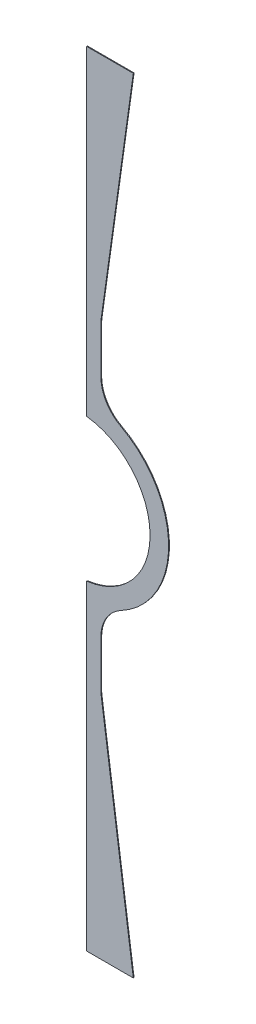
ISO-10303-21;
HEADER;
FILE_DESCRIPTION(('STEP AP214'),'2;1');
FILE_NAME('part.step','',(''),(''),'','','');
FILE_SCHEMA(('AUTOMOTIVE_DESIGN { 1 0 10303 214 1 1 1 1 }'));
ENDSEC;
DATA;
#1=APPLICATION_CONTEXT('core data for automotive mechanical design processes');
#2=APPLICATION_PROTOCOL_DEFINITION('international standard','automotive_design',2000,#1);
#3=PRODUCT_CONTEXT('',#1,'mechanical');
#4=PRODUCT('Part','Part','',(#3));
#5=PRODUCT_RELATED_PRODUCT_CATEGORY('part','',(#4));
#6=PRODUCT_DEFINITION_FORMATION('','',#4);
#7=PRODUCT_DEFINITION_CONTEXT('part definition',#1,'design');
#8=PRODUCT_DEFINITION('design','',#6,#7);
#9=PRODUCT_DEFINITION_SHAPE('','',#8);
#10=(LENGTH_UNIT() NAMED_UNIT(*) SI_UNIT(.MILLI.,.METRE.));
#11=(NAMED_UNIT(*) PLANE_ANGLE_UNIT() SI_UNIT($,.RADIAN.));
#12=(NAMED_UNIT(*) SI_UNIT($,.STERADIAN.) SOLID_ANGLE_UNIT());
#13=UNCERTAINTY_MEASURE_WITH_UNIT(LENGTH_MEASURE(1.E-05),#10,'distance_accuracy_value','');
#14=(GEOMETRIC_REPRESENTATION_CONTEXT(3) GLOBAL_UNCERTAINTY_ASSIGNED_CONTEXT((#13)) GLOBAL_UNIT_ASSIGNED_CONTEXT((#10,
#11,#12)) REPRESENTATION_CONTEXT('',''));
#15=CARTESIAN_POINT('',(0.,0.,0.));
#16=DIRECTION('',(0.,0.,1.));
#17=DIRECTION('',(1.,0.,0.));
#18=AXIS2_PLACEMENT_3D('',#15,#16,#17);
#19=CARTESIAN_POINT('',(32.,83.9859004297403,0.205));
#20=DIRECTION('',(0.,0.,-1.));
#21=DIRECTION('',(-1.,0.,0.));
#22=AXIS2_PLACEMENT_3D('',#19,#20,#21);
#23=CYLINDRICAL_SURFACE('',#22,20.);
#24=CARTESIAN_POINT('',(32.,83.9859004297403,-0.205));
#25=DIRECTION('',(0.,0.,-1.));
#26=DIRECTION('',(1.,0.,0.));
#27=AXIS2_PLACEMENT_3D('',#24,#25,#26);
#28=CIRCLE('',#27,20.);
#29=CARTESIAN_POINT('',(12.,83.9859004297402,-0.205));
#30=VERTEX_POINT('',#29);
#31=CARTESIAN_POINT('',(12.1946386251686,86.7693624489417,-0.205));
#32=VERTEX_POINT('',#31);
#33=EDGE_CURVE('E163',#30,#32,#28,.T.);
#34=ORIENTED_EDGE('',*,*,#33,.T.);
#35=DIRECTION('',(0.,0.,-1.));
#36=VECTOR('',#35,1.);
#37=CARTESIAN_POINT('',(12.1946386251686,86.7693624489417,0.205));
#38=LINE('',#37,#36);
#39=CARTESIAN_POINT('',(12.1946386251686,86.7693624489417,0.205));
#40=VERTEX_POINT('',#39);
#41=EDGE_CURVE('E11',#40,#32,#38,.T.);
#42=ORIENTED_EDGE('',*,*,#41,.F.);
#43=CARTESIAN_POINT('',(32.,83.9859004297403,0.205));
#44=DIRECTION('',(0.,0.,-1.));
#45=DIRECTION('',(1.,0.,0.));
#46=AXIS2_PLACEMENT_3D('',#43,#44,#45);
#47=CIRCLE('',#46,20.);
#48=CARTESIAN_POINT('',(12.,83.9859004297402,0.205));
#49=VERTEX_POINT('',#48);
#50=EDGE_CURVE('E189',#49,#40,#47,.T.);
#51=ORIENTED_EDGE('',*,*,#50,.F.);
#52=DIRECTION('',(0.,0.,-1.));
#53=VECTOR('',#52,1.);
#54=CARTESIAN_POINT('',(12.,83.9859004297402,0.205));
#55=LINE('',#54,#53);
#56=EDGE_CURVE('E159',#49,#30,#55,.T.);
#57=ORIENTED_EDGE('',*,*,#56,.T.);
#58=EDGE_LOOP('',(#34,#42,#51,#57));
#59=FACE_BOUND('',#58,.T.);
#60=ADVANCED_FACE('F31',(#59),#23,.F.);
#61=CARTESIAN_POINT('',(29.2324936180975,208.,0.205));
#62=DIRECTION('',(-0.99026806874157,0.139173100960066,0.));
#63=DIRECTION('',(-0.139173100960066,-0.99026806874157,0.));
#64=AXIS2_PLACEMENT_3D('',#61,#62,#63);
#65=PLANE('',#64);
#66=DIRECTION('',(0.139173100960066,0.99026806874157,0.));
#67=VECTOR('',#66,1.);
#68=CARTESIAN_POINT('',(29.2324936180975,208.,-0.205));
#69=LINE('',#68,#67);
#70=CARTESIAN_POINT('',(29.2324936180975,208.,-0.205));
#71=VERTEX_POINT('',#70);
#72=EDGE_CURVE('E166',#32,#71,#69,.T.);
#73=ORIENTED_EDGE('',*,*,#72,.T.);
#74=DIRECTION('',(0.,0.,-1.));
#75=VECTOR('',#74,1.);
#76=CARTESIAN_POINT('',(29.2324936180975,208.,0.205));
#77=LINE('',#76,#75);
#78=CARTESIAN_POINT('',(29.2324936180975,208.,0.205));
#79=VERTEX_POINT('',#78);
#80=EDGE_CURVE('E39',#79,#71,#77,.T.);
#81=ORIENTED_EDGE('',*,*,#80,.F.);
#82=DIRECTION('',(0.139173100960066,0.99026806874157,0.));
#83=VECTOR('',#82,1.);
#84=CARTESIAN_POINT('',(29.2324936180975,208.,0.205));
#85=LINE('',#84,#83);
#86=EDGE_CURVE('E108',#40,#79,#85,.T.);
#87=ORIENTED_EDGE('',*,*,#86,.F.);
#88=ORIENTED_EDGE('',*,*,#41,.T.);
#89=EDGE_LOOP('',(#73,#81,#87,#88));
#90=FACE_BOUND('',#89,.T.);
#91=ADVANCED_FACE('F277',(#90),#65,.F.);
#92=CARTESIAN_POINT('',(29.2324936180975,208.,0.205));
#93=DIRECTION('',(0.,-1.,0.));
#94=DIRECTION('',(0.,0.,-1.));
#95=AXIS2_PLACEMENT_3D('',#92,#93,#94);
#96=PLANE('',#95);
#97=DIRECTION('',(-1.,0.,0.));
#98=VECTOR('',#97,1.);
#99=CARTESIAN_POINT('',(29.2324936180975,208.,-0.205));
#100=LINE('',#99,#98);
#101=CARTESIAN_POINT('',(4.49999999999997,208.,-0.205));
#102=VERTEX_POINT('',#101);
#103=EDGE_CURVE('E168',#71,#102,#100,.T.);
#104=ORIENTED_EDGE('',*,*,#103,.T.);
#105=DIRECTION('',(0.,0.,-1.));
#106=VECTOR('',#105,1.);
#107=CARTESIAN_POINT('',(4.49999999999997,208.,0.205));
#108=LINE('',#107,#106);
#109=CARTESIAN_POINT('',(4.49999999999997,208.,0.205));
#110=VERTEX_POINT('',#109);
#111=EDGE_CURVE('E214',#110,#102,#108,.T.);
#112=ORIENTED_EDGE('',*,*,#111,.F.);
#113=DIRECTION('',(-1.,0.,0.));
#114=VECTOR('',#113,1.);
#115=CARTESIAN_POINT('',(29.2324936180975,208.,0.205));
#116=LINE('',#115,#114);
#117=EDGE_CURVE('E222',#79,#110,#116,.T.);
#118=ORIENTED_EDGE('',*,*,#117,.F.);
#119=ORIENTED_EDGE('',*,*,#80,.T.);
#120=EDGE_LOOP('',(#104,#112,#118,#119));
#121=FACE_BOUND('',#120,.T.);
#122=ADVANCED_FACE('F220',(#121),#96,.F.);
#123=CARTESIAN_POINT('',(4.49999999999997,208.,0.205));
#124=DIRECTION('',(1.,0.,0.));
#125=DIRECTION('',(0.,1.,0.));
#126=AXIS2_PLACEMENT_3D('',#123,#124,#125);
#127=PLANE('',#126);
#128=DIRECTION('',(0.,-1.,0.));
#129=VECTOR('',#128,1.);
#130=CARTESIAN_POINT('',(4.49999999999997,208.,-0.205));
#131=LINE('',#130,#129);
#132=CARTESIAN_POINT('',(4.49999999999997,37.8736723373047,-0.205));
#133=VERTEX_POINT('',#132);
#134=EDGE_CURVE('E170',#102,#133,#131,.T.);
#135=ORIENTED_EDGE('',*,*,#134,.T.);
#136=DIRECTION('',(0.,0.,-1.));
#137=VECTOR('',#136,1.);
#138=CARTESIAN_POINT('',(4.49999999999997,37.8736723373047,0.205));
#139=LINE('',#138,#137);
#140=CARTESIAN_POINT('',(4.49999999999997,37.8736723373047,0.205));
#141=VERTEX_POINT('',#140);
#142=EDGE_CURVE('E211',#141,#133,#139,.T.);
#143=ORIENTED_EDGE('',*,*,#142,.F.);
#144=DIRECTION('',(0.,-1.,0.));
#145=VECTOR('',#144,1.);
#146=CARTESIAN_POINT('',(4.49999999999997,208.,0.205));
#147=LINE('',#146,#145);
#148=EDGE_CURVE('E240',#110,#141,#147,.T.);
#149=ORIENTED_EDGE('',*,*,#148,.F.);
#150=ORIENTED_EDGE('',*,*,#111,.T.);
#151=EDGE_LOOP('',(#135,#143,#149,#150));
#152=FACE_BOUND('',#151,.T.);
#153=ADVANCED_FACE('F231',(#152),#127,.F.);
#154=CARTESIAN_POINT('',(0.,0.,0.205));
#155=DIRECTION('',(0.,0.,-1.));
#156=DIRECTION('',(-1.,0.,0.));
#157=AXIS2_PLACEMENT_3D('',#154,#155,#156);
#158=CYLINDRICAL_SURFACE('',#157,38.14007153);
#159=CARTESIAN_POINT('',(0.,0.,-0.205));
#160=DIRECTION('',(0.,0.,-1.));
#161=DIRECTION('',(1.,0.,0.));
#162=AXIS2_PLACEMENT_3D('',#159,#160,#161);
#163=CIRCLE('',#162,38.14007153);
#164=CARTESIAN_POINT('',(4.49999999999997,-37.8736723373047,-0.205));
#165=VERTEX_POINT('',#164);
#166=EDGE_CURVE('E172',#133,#165,#163,.T.);
#167=ORIENTED_EDGE('',*,*,#166,.T.);
#168=DIRECTION('',(0.,0.,-1.));
#169=VECTOR('',#168,1.);
#170=CARTESIAN_POINT('',(4.49999999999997,-37.8736723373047,0.205));
#171=LINE('',#170,#169);
#172=CARTESIAN_POINT('',(4.49999999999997,-37.8736723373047,0.205));
#173=VERTEX_POINT('',#172);
#174=EDGE_CURVE('E208',#173,#165,#171,.T.);
#175=ORIENTED_EDGE('',*,*,#174,.F.);
#176=CARTESIAN_POINT('',(0.,0.,0.205));
#177=DIRECTION('',(0.,0.,-1.));
#178=DIRECTION('',(1.,0.,0.));
#179=AXIS2_PLACEMENT_3D('',#176,#177,#178);
#180=CIRCLE('',#179,38.14007153);
#181=EDGE_CURVE('E237',#141,#173,#180,.T.);
#182=ORIENTED_EDGE('',*,*,#181,.F.);
#183=ORIENTED_EDGE('',*,*,#142,.T.);
#184=EDGE_LOOP('',(#167,#175,#182,#183));
#185=FACE_BOUND('',#184,.T.);
#186=ADVANCED_FACE('F235',(#185),#158,.F.);
#187=CARTESIAN_POINT('',(4.50000000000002,-208.,0.205));
#188=DIRECTION('',(1.,0.,0.));
#189=DIRECTION('',(0.,1.,0.));
#190=AXIS2_PLACEMENT_3D('',#187,#188,#189);
#191=PLANE('',#190);
#192=DIRECTION('',(0.,-1.,0.));
#193=VECTOR('',#192,1.);
#194=CARTESIAN_POINT('',(4.50000000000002,-208.,-0.205));
#195=LINE('',#194,#193);
#196=CARTESIAN_POINT('',(4.50000000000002,-208.,-0.205));
#197=VERTEX_POINT('',#196);
#198=EDGE_CURVE('E174',#165,#197,#195,.T.);
#199=ORIENTED_EDGE('',*,*,#198,.T.);
#200=DIRECTION('',(0.,0.,-1.));
#201=VECTOR('',#200,1.);
#202=CARTESIAN_POINT('',(4.50000000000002,-208.,0.205));
#203=LINE('',#202,#201);
#204=CARTESIAN_POINT('',(4.50000000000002,-208.,0.205));
#205=VERTEX_POINT('',#204);
#206=EDGE_CURVE('E205',#205,#197,#203,.T.);
#207=ORIENTED_EDGE('',*,*,#206,.F.);
#208=DIRECTION('',(0.,-1.,0.));
#209=VECTOR('',#208,1.);
#210=CARTESIAN_POINT('',(4.50000000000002,-208.,0.205));
#211=LINE('',#210,#209);
#212=EDGE_CURVE('E239',#173,#205,#211,.T.);
#213=ORIENTED_EDGE('',*,*,#212,.F.);
#214=ORIENTED_EDGE('',*,*,#174,.T.);
#215=EDGE_LOOP('',(#199,#207,#213,#214));
#216=FACE_BOUND('',#215,.T.);
#217=ADVANCED_FACE('F290',(#216),#191,.F.);
#218=CARTESIAN_POINT('',(29.2324936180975,-208.,0.205));
#219=DIRECTION('',(0.,1.,0.));
#220=DIRECTION('',(0.,0.,1.));
#221=AXIS2_PLACEMENT_3D('',#218,#219,#220);
#222=PLANE('',#221);
#223=DIRECTION('',(1.,0.,0.));
#224=VECTOR('',#223,1.);
#225=CARTESIAN_POINT('',(29.2324936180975,-208.,-0.205));
#226=LINE('',#225,#224);
#227=CARTESIAN_POINT('',(29.2324936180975,-208.,-0.205));
#228=VERTEX_POINT('',#227);
#229=EDGE_CURVE('E176',#197,#228,#226,.T.);
#230=ORIENTED_EDGE('',*,*,#229,.T.);
#231=DIRECTION('',(0.,0.,-1.));
#232=VECTOR('',#231,1.);
#233=CARTESIAN_POINT('',(29.2324936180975,-208.,0.205));
#234=LINE('',#233,#232);
#235=CARTESIAN_POINT('',(29.2324936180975,-208.,0.205));
#236=VERTEX_POINT('',#235);
#237=EDGE_CURVE('E202',#236,#228,#234,.T.);
#238=ORIENTED_EDGE('',*,*,#237,.F.);
#239=DIRECTION('',(1.,0.,0.));
#240=VECTOR('',#239,1.);
#241=CARTESIAN_POINT('',(29.2324936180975,-208.,0.205));
#242=LINE('',#241,#240);
#243=EDGE_CURVE('E242',#205,#236,#242,.T.);
#244=ORIENTED_EDGE('',*,*,#243,.F.);
#245=ORIENTED_EDGE('',*,*,#206,.T.);
#246=EDGE_LOOP('',(#230,#238,#244,#245));
#247=FACE_BOUND('',#246,.T.);
#248=ADVANCED_FACE('F293',(#247),#222,.F.);
#249=CARTESIAN_POINT('',(29.2324936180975,-208.,0.205));
#250=DIRECTION('',(-0.99026806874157,-0.139173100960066,0.));
#251=DIRECTION('',(0.139173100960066,-0.99026806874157,0.));
#252=AXIS2_PLACEMENT_3D('',#249,#250,#251);
#253=PLANE('',#252);
#254=DIRECTION('',(-0.139173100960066,0.99026806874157,0.));
#255=VECTOR('',#254,1.);
#256=CARTESIAN_POINT('',(29.2324936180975,-208.,-0.205));
#257=LINE('',#256,#255);
#258=CARTESIAN_POINT('',(12.1946386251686,-86.7693624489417,-0.205));
#259=VERTEX_POINT('',#258);
#260=EDGE_CURVE('E178',#228,#259,#257,.T.);
#261=ORIENTED_EDGE('',*,*,#260,.T.);
#262=DIRECTION('',(0.,0.,-1.));
#263=VECTOR('',#262,1.);
#264=CARTESIAN_POINT('',(12.1946386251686,-86.7693624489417,0.205));
#265=LINE('',#264,#263);
#266=CARTESIAN_POINT('',(12.1946386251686,-86.7693624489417,0.205));
#267=VERTEX_POINT('',#266);
#268=EDGE_CURVE('E199',#267,#259,#265,.T.);
#269=ORIENTED_EDGE('',*,*,#268,.F.);
#270=DIRECTION('',(-0.139173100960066,0.99026806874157,0.));
#271=VECTOR('',#270,1.);
#272=CARTESIAN_POINT('',(29.2324936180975,-208.,0.205));
#273=LINE('',#272,#271);
#274=EDGE_CURVE('E248',#236,#267,#273,.T.);
#275=ORIENTED_EDGE('',*,*,#274,.F.);
#276=ORIENTED_EDGE('',*,*,#237,.T.);
#277=EDGE_LOOP('',(#261,#269,#275,#276));
#278=FACE_BOUND('',#277,.T.);
#279=ADVANCED_FACE('F297',(#278),#253,.F.);
#280=CARTESIAN_POINT('',(32.,-83.9859004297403,0.205));
#281=DIRECTION('',(0.,0.,-1.));
#282=DIRECTION('',(-1.,0.,0.));
#283=AXIS2_PLACEMENT_3D('',#280,#281,#282);
#284=CYLINDRICAL_SURFACE('',#283,20.);
#285=CARTESIAN_POINT('',(32.,-83.9859004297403,-0.205));
#286=DIRECTION('',(0.,0.,-1.));
#287=DIRECTION('',(-1.,0.,0.));
#288=AXIS2_PLACEMENT_3D('',#285,#286,#287);
#289=CIRCLE('',#288,20.);
#290=CARTESIAN_POINT('',(12.,-83.9859004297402,-0.205));
#291=VERTEX_POINT('',#290);
#292=EDGE_CURVE('E180',#259,#291,#289,.T.);
#293=ORIENTED_EDGE('',*,*,#292,.T.);
#294=DIRECTION('',(0.,0.,-1.));
#295=VECTOR('',#294,1.);
#296=CARTESIAN_POINT('',(12.,-83.9859004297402,0.205));
#297=LINE('',#296,#295);
#298=CARTESIAN_POINT('',(12.,-83.9859004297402,0.205));
#299=VERTEX_POINT('',#298);
#300=EDGE_CURVE('E196',#299,#291,#297,.T.);
#301=ORIENTED_EDGE('',*,*,#300,.F.);
#302=CARTESIAN_POINT('',(32.,-83.9859004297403,0.205));
#303=DIRECTION('',(0.,0.,-1.));
#304=DIRECTION('',(-1.,0.,0.));
#305=AXIS2_PLACEMENT_3D('',#302,#303,#304);
#306=CIRCLE('',#305,20.);
#307=EDGE_CURVE('E250',#267,#299,#306,.T.);
#308=ORIENTED_EDGE('',*,*,#307,.F.);
#309=ORIENTED_EDGE('',*,*,#268,.T.);
#310=EDGE_LOOP('',(#293,#301,#308,#309));
#311=FACE_BOUND('',#310,.T.);
#312=ADVANCED_FACE('F301',(#311),#284,.F.);
#313=CARTESIAN_POINT('',(12.,-83.9859004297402,0.205));
#314=DIRECTION('',(-1.,0.,0.));
#315=DIRECTION('',(0.,-1.,0.));
#316=AXIS2_PLACEMENT_3D('',#313,#314,#315);
#317=PLANE('',#316);
#318=DIRECTION('',(0.,1.,0.));
#319=VECTOR('',#318,1.);
#320=CARTESIAN_POINT('',(12.,-83.9859004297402,-0.205));
#321=LINE('',#320,#319);
#322=CARTESIAN_POINT('',(12.,-60.,-0.205));
#323=VERTEX_POINT('',#322);
#324=EDGE_CURVE('E182',#291,#323,#321,.T.);
#325=ORIENTED_EDGE('',*,*,#324,.T.);
#326=DIRECTION('',(0.,0.,-1.));
#327=VECTOR('',#326,1.);
#328=CARTESIAN_POINT('',(12.,-60.,0.205));
#329=LINE('',#328,#327);
#330=CARTESIAN_POINT('',(12.,-60.,0.205));
#331=VERTEX_POINT('',#330);
#332=EDGE_CURVE('E193',#331,#323,#329,.T.);
#333=ORIENTED_EDGE('',*,*,#332,.F.);
#334=DIRECTION('',(0.,1.,0.));
#335=VECTOR('',#334,1.);
#336=CARTESIAN_POINT('',(12.,-83.9859004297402,0.205));
#337=LINE('',#336,#335);
#338=EDGE_CURVE('E252',#299,#331,#337,.T.);
#339=ORIENTED_EDGE('',*,*,#338,.F.);
#340=ORIENTED_EDGE('',*,*,#300,.T.);
#341=EDGE_LOOP('',(#325,#333,#339,#340));
#342=FACE_BOUND('',#341,.T.);
#343=ADVANCED_FACE('F258',(#342),#317,.F.);
#344=CARTESIAN_POINT('',(32.,-60.,0.205));
#345=DIRECTION('',(0.,0.,-1.));
#346=DIRECTION('',(-1.,0.,0.));
#347=AXIS2_PLACEMENT_3D('',#344,#345,#346);
#348=CYLINDRICAL_SURFACE('',#347,20.);
#349=CARTESIAN_POINT('',(32.,-60.,-0.205));
#350=DIRECTION('',(0.,0.,-1.));
#351=DIRECTION('',(1.,0.,0.));
#352=AXIS2_PLACEMENT_3D('',#349,#350,#351);
#353=CIRCLE('',#352,20.);
#354=CARTESIAN_POINT('',(22.5882352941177,-42.3529411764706,-0.205));
#355=VERTEX_POINT('',#354);
#356=EDGE_CURVE('E184',#323,#355,#353,.T.);
#357=ORIENTED_EDGE('',*,*,#356,.T.);
#358=DIRECTION('',(0.,0.,-1.));
#359=VECTOR('',#358,1.);
#360=CARTESIAN_POINT('',(22.5882352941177,-42.3529411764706,0.205));
#361=LINE('',#360,#359);
#362=CARTESIAN_POINT('',(22.5882352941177,-42.3529411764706,0.205));
#363=VERTEX_POINT('',#362);
#364=EDGE_CURVE('E154',#363,#355,#361,.T.);
#365=ORIENTED_EDGE('',*,*,#364,.F.);
#366=CARTESIAN_POINT('',(32.,-60.,0.205));
#367=DIRECTION('',(0.,0.,-1.));
#368=DIRECTION('',(1.,0.,0.));
#369=AXIS2_PLACEMENT_3D('',#366,#367,#368);
#370=CIRCLE('',#369,20.);
#371=EDGE_CURVE('E145',#331,#363,#370,.T.);
#372=ORIENTED_EDGE('',*,*,#371,.F.);
#373=ORIENTED_EDGE('',*,*,#332,.T.);
#374=EDGE_LOOP('',(#357,#365,#372,#373));
#375=FACE_BOUND('',#374,.T.);
#376=ADVANCED_FACE('F262',(#375),#348,.F.);
#377=CARTESIAN_POINT('',(0.,0.,0.205));
#378=DIRECTION('',(0.,0.,-1.));
#379=DIRECTION('',(-1.,0.,0.));
#380=AXIS2_PLACEMENT_3D('',#377,#378,#379);
#381=CYLINDRICAL_SURFACE('',#380,48.);
#382=CARTESIAN_POINT('',(0.,0.,-0.205));
#383=DIRECTION('',(0.,0.,1.));
#384=DIRECTION('',(1.,0.,0.));
#385=AXIS2_PLACEMENT_3D('',#382,#383,#384);
#386=CIRCLE('',#385,48.);
#387=CARTESIAN_POINT('',(22.5882352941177,42.3529411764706,-0.205));
#388=VERTEX_POINT('',#387);
#389=EDGE_CURVE('E153',#355,#388,#386,.T.);
#390=ORIENTED_EDGE('',*,*,#389,.T.);
#391=DIRECTION('',(0.,0.,-1.));
#392=VECTOR('',#391,1.);
#393=CARTESIAN_POINT('',(22.5882352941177,42.3529411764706,0.205));
#394=LINE('',#393,#392);
#395=CARTESIAN_POINT('',(22.5882352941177,42.3529411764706,0.205));
#396=VERTEX_POINT('',#395);
#397=EDGE_CURVE('E150',#396,#388,#394,.T.);
#398=ORIENTED_EDGE('',*,*,#397,.F.);
#399=CARTESIAN_POINT('',(0.,0.,0.205));
#400=DIRECTION('',(0.,0.,1.));
#401=DIRECTION('',(1.,0.,0.));
#402=AXIS2_PLACEMENT_3D('',#399,#400,#401);
#403=CIRCLE('',#402,48.);
#404=EDGE_CURVE('E139',#363,#396,#403,.T.);
#405=ORIENTED_EDGE('',*,*,#404,.F.);
#406=ORIENTED_EDGE('',*,*,#364,.T.);
#407=EDGE_LOOP('',(#390,#398,#405,#406));
#408=FACE_BOUND('',#407,.T.);
#409=ADVANCED_FACE('F151',(#408),#381,.T.);
#410=CARTESIAN_POINT('',(32.,60.,0.205));
#411=DIRECTION('',(0.,0.,-1.));
#412=DIRECTION('',(-1.,0.,0.));
#413=AXIS2_PLACEMENT_3D('',#410,#411,#412);
#414=CYLINDRICAL_SURFACE('',#413,20.);
#415=CARTESIAN_POINT('',(32.,60.,-0.205));
#416=DIRECTION('',(0.,0.,-1.));
#417=DIRECTION('',(-1.,0.,0.));
#418=AXIS2_PLACEMENT_3D('',#415,#416,#417);
#419=CIRCLE('',#418,20.);
#420=CARTESIAN_POINT('',(12.,60.,-0.205));
#421=VERTEX_POINT('',#420);
#422=EDGE_CURVE('E94',#388,#421,#419,.T.);
#423=ORIENTED_EDGE('',*,*,#422,.T.);
#424=DIRECTION('',(0.,0.,-1.));
#425=VECTOR('',#424,1.);
#426=CARTESIAN_POINT('',(12.,60.,0.205));
#427=LINE('',#426,#425);
#428=CARTESIAN_POINT('',(12.,60.,0.205));
#429=VERTEX_POINT('',#428);
#430=EDGE_CURVE('E155',#429,#421,#427,.T.);
#431=ORIENTED_EDGE('',*,*,#430,.F.);
#432=CARTESIAN_POINT('',(32.,60.,0.205));
#433=DIRECTION('',(0.,0.,-1.));
#434=DIRECTION('',(-1.,0.,0.));
#435=AXIS2_PLACEMENT_3D('',#432,#433,#434);
#436=CIRCLE('',#435,20.);
#437=EDGE_CURVE('E143',#396,#429,#436,.T.);
#438=ORIENTED_EDGE('',*,*,#437,.F.);
#439=ORIENTED_EDGE('',*,*,#397,.T.);
#440=EDGE_LOOP('',(#423,#431,#438,#439));
#441=FACE_BOUND('',#440,.T.);
#442=ADVANCED_FACE('F157',(#441),#414,.F.);
#443=CARTESIAN_POINT('',(12.,83.9859004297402,0.205));
#444=DIRECTION('',(-1.,0.,0.));
#445=DIRECTION('',(0.,-1.,0.));
#446=AXIS2_PLACEMENT_3D('',#443,#444,#445);
#447=PLANE('',#446);
#448=DIRECTION('',(0.,1.,0.));
#449=VECTOR('',#448,1.);
#450=CARTESIAN_POINT('',(12.,83.9859004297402,-0.205));
#451=LINE('',#450,#449);
#452=EDGE_CURVE('E100',#421,#30,#451,.T.);
#453=ORIENTED_EDGE('',*,*,#452,.T.);
#454=ORIENTED_EDGE('',*,*,#56,.F.);
#455=DIRECTION('',(0.,1.,0.));
#456=VECTOR('',#455,1.);
#457=CARTESIAN_POINT('',(12.,83.9859004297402,0.205));
#458=LINE('',#457,#456);
#459=EDGE_CURVE('E47',#429,#49,#458,.T.);
#460=ORIENTED_EDGE('',*,*,#459,.F.);
#461=ORIENTED_EDGE('',*,*,#430,.T.);
#462=EDGE_LOOP('',(#453,#454,#460,#461));
#463=FACE_BOUND('',#462,.T.);
#464=ADVANCED_FACE('F266',(#463),#447,.F.);
#465=CARTESIAN_POINT('',(32.,83.9859004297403,0.205));
#466=DIRECTION('',(0.,0.,1.));
#467=DIRECTION('',(1.,0.,0.));
#468=AXIS2_PLACEMENT_3D('',#465,#466,#467);
#469=PLANE('',#468);
#470=ORIENTED_EDGE('',*,*,#50,.T.);
#471=ORIENTED_EDGE('',*,*,#86,.T.);
#472=ORIENTED_EDGE('',*,*,#117,.T.);
#473=ORIENTED_EDGE('',*,*,#148,.T.);
#474=ORIENTED_EDGE('',*,*,#181,.T.);
#475=ORIENTED_EDGE('',*,*,#212,.T.);
#476=ORIENTED_EDGE('',*,*,#243,.T.);
#477=ORIENTED_EDGE('',*,*,#274,.T.);
#478=ORIENTED_EDGE('',*,*,#307,.T.);
#479=ORIENTED_EDGE('',*,*,#338,.T.);
#480=ORIENTED_EDGE('',*,*,#371,.T.);
#481=ORIENTED_EDGE('',*,*,#404,.T.);
#482=ORIENTED_EDGE('',*,*,#437,.T.);
#483=ORIENTED_EDGE('',*,*,#459,.T.);
#484=EDGE_LOOP('',(#470,#471,#472,#473,#474,#475,#476,#477,#478,#479,#480,#481,#482,#483));
#485=FACE_BOUND('',#484,.T.);
#486=ADVANCED_FACE('F141',(#485),#469,.T.);
#487=CARTESIAN_POINT('',(32.,83.9859004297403,-0.205));
#488=DIRECTION('',(0.,0.,1.));
#489=DIRECTION('',(1.,0.,0.));
#490=AXIS2_PLACEMENT_3D('',#487,#488,#489);
#491=PLANE('',#490);
#492=ORIENTED_EDGE('',*,*,#33,.F.);
#493=ORIENTED_EDGE('',*,*,#452,.F.);
#494=ORIENTED_EDGE('',*,*,#422,.F.);
#495=ORIENTED_EDGE('',*,*,#389,.F.);
#496=ORIENTED_EDGE('',*,*,#356,.F.);
#497=ORIENTED_EDGE('',*,*,#324,.F.);
#498=ORIENTED_EDGE('',*,*,#292,.F.);
#499=ORIENTED_EDGE('',*,*,#260,.F.);
#500=ORIENTED_EDGE('',*,*,#229,.F.);
#501=ORIENTED_EDGE('',*,*,#198,.F.);
#502=ORIENTED_EDGE('',*,*,#166,.F.);
#503=ORIENTED_EDGE('',*,*,#134,.F.);
#504=ORIENTED_EDGE('',*,*,#103,.F.);
#505=ORIENTED_EDGE('',*,*,#72,.F.);
#506=EDGE_LOOP('',(#492,#493,#494,#495,#496,#497,#498,#499,#500,#501,#502,#503,#504,#505));
#507=FACE_BOUND('',#506,.T.);
#508=ADVANCED_FACE('F226',(#507),#491,.F.);
#509=CLOSED_SHELL('',(#60,#91,#122,#153,#186,#217,#248,#279,#312,#343,#376,#409,#442,#464,#486,#508));
#510=MANIFOLD_SOLID_BREP('B2',#509);
#511=ADVANCED_BREP_SHAPE_REPRESENTATION('',(#18,#510),#14);
#512=SHAPE_DEFINITION_REPRESENTATION(#9,#511);
ENDSEC;
END-ISO-10303-21;
